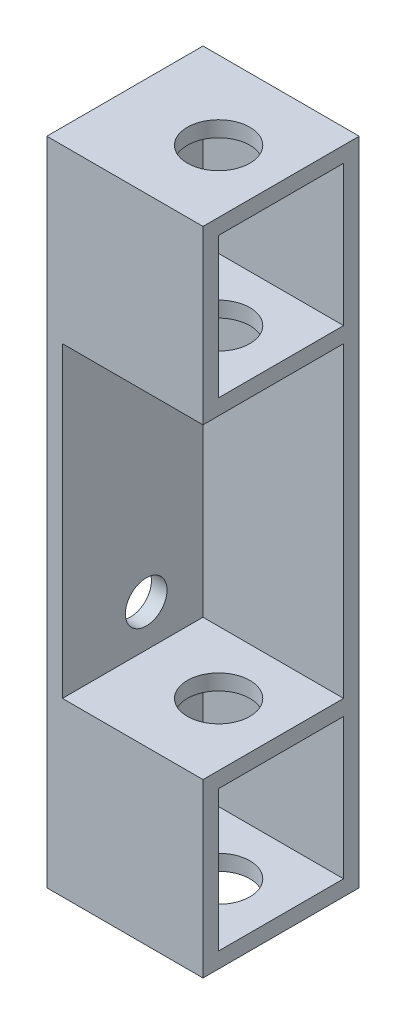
from build123d import *

# Parameters (mm, degrees)
SKETCH2_W           = 30
SKETCH2_H           = 125
BOSS_EXTRUDE1_DEPTH = 3
SKETCH3_W           = 3
SKETCH3_H           = 125
BOSS_EXTRUDE2_DEPTH = 27
SKETCH4_W           = 30
SKETCH4_H           = 30
BOSS_EXTRUDE3_DEPTH = 3
SKETCH5_W           = 30
SKETCH5_H           = 30
BOSS_EXTRUDE4_DEPTH = 3
SKETCH6_W           = 30
SKETCH6_H           = 30
BOSS_EXTRUDE5_DEPTH = 3
SKETCH7_W           = 27
SKETCH7_H           = 27
BOSS_EXTRUDE6_DEPTH = 3
SKETCH8_W           = 27
SKETCH8_H           = 27
BOSS_EXTRUDE7_DEPTH = 3
SKETCH9_R           = 6
CUT_EXTRUDE1_DEPTH  = 127.787223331
SKETCH10_R          = 4
CUT_EXTRUDE2_DEPTH  = 3


with BuildPart() as part:
    # Sketch2 → Boss-Extrude1 (new body)
    with BuildSketch(Plane(origin=(-15, 0, 0), x_dir=(0, 0, -1), z_dir=(1, 0, 0))):
        Rectangle(SKETCH2_W, SKETCH2_H)
    extrude(amount=BOSS_EXTRUDE1_DEPTH)

    # Sketch3 → Boss-Extrude2 (add)
    with BuildSketch(Plane(origin=(-12, 0, 0), x_dir=(0, 0, -1), z_dir=(1, 0, 0))):
        with Locations((13.5, 0)):
            Rectangle(SKETCH3_W, SKETCH3_H)
    extrude(amount=BOSS_EXTRUDE2_DEPTH)

    # Sketch4 → Boss-Extrude3 (add)
    with BuildSketch(Plane(origin=(0, 62.5, 0), x_dir=(1, 0, 0), z_dir=(0, 1, 0))):
        Rectangle(SKETCH4_W, SKETCH4_H)
    extrude(amount=-BOSS_EXTRUDE3_DEPTH)

    # Sketch5 → Boss-Extrude4 (add)
    with BuildSketch(Plane.XY.offset(15)):
        with Locations((0, 47.5)):
            Rectangle(SKETCH5_W, SKETCH5_H)
        with Locations((0, -47.5)):
            Rectangle(SKETCH5_W, SKETCH5_H)
    extrude(amount=-BOSS_EXTRUDE4_DEPTH)

    # Sketch6 → Boss-Extrude5 (add)
    with BuildSketch(Plane.XZ.offset(62.5)):
        Rectangle(SKETCH6_W, SKETCH6_H)
    extrude(amount=-BOSS_EXTRUDE5_DEPTH)

    # Sketch7 → Boss-Extrude6 (add)
    with BuildSketch(Plane(origin=(0, -32.5, 0), x_dir=(1, 0, 0), z_dir=(0, 1, 0))):
        with Locations((1.5, -1.5)):
            Rectangle(SKETCH7_W, SKETCH7_H)
    extrude(amount=BOSS_EXTRUDE6_DEPTH)

    # Sketch8 → Boss-Extrude7 (add)
    with BuildSketch(Plane.XZ.offset(-32.5)):
        with Locations((1.5, 1.5)):
            Rectangle(SKETCH8_W, SKETCH8_H)
    extrude(amount=BOSS_EXTRUDE7_DEPTH)

    # Sketch9 → Cut-Extrude1 (cut, through all)
    with BuildSketch(Plane(origin=(0, 62.5, 0), x_dir=(1, 0, 0), z_dir=(0, 1, 0))):
        with Locations(Location((3, 0, 0), (0, 0, 270))):
            Circle(SKETCH9_R)
    extrude(amount=-CUT_EXTRUDE1_DEPTH, mode=Mode.SUBTRACT)

    # Sketch10 → Cut-Extrude2 (cut)
    with BuildSketch(Plane(origin=(-12, 0, 0), x_dir=(0, 0, -1), z_dir=(1, 0, 0))):
        with Locations((1.093220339, -21.5)):
            Circle(SKETCH10_R)
        with Locations((-1.093220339, 21.5)):
            Circle(SKETCH10_R)
    extrude(amount=-CUT_EXTRUDE2_DEPTH, mode=Mode.SUBTRACT)


solid = part.part
